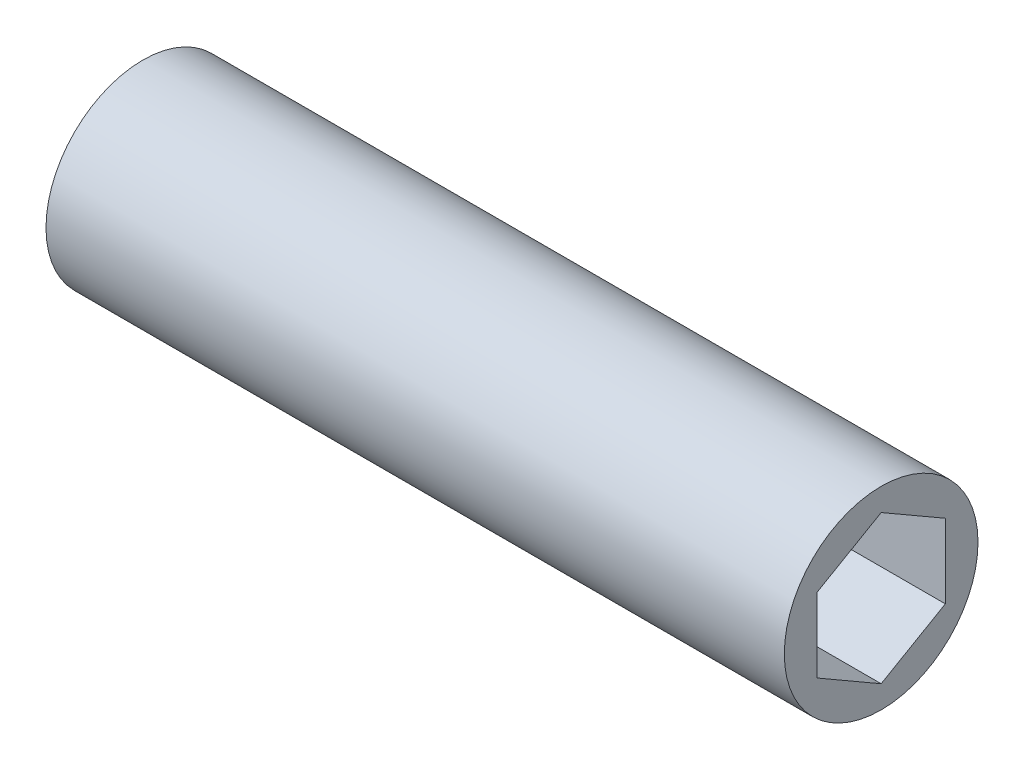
ISO-10303-21;
HEADER;
FILE_DESCRIPTION(('STEP AP214'),'2;1');
FILE_NAME('part.step','',(''),(''),'','','');
FILE_SCHEMA(('AUTOMOTIVE_DESIGN { 1 0 10303 214 1 1 1 1 }'));
ENDSEC;
DATA;
#1=APPLICATION_CONTEXT('core data for automotive mechanical design processes');
#2=APPLICATION_PROTOCOL_DEFINITION('international standard','automotive_design',2000,#1);
#3=PRODUCT_CONTEXT('',#1,'mechanical');
#4=PRODUCT('Part','Part','',(#3));
#5=PRODUCT_RELATED_PRODUCT_CATEGORY('part','',(#4));
#6=PRODUCT_DEFINITION_FORMATION('','',#4);
#7=PRODUCT_DEFINITION_CONTEXT('part definition',#1,'design');
#8=PRODUCT_DEFINITION('design','',#6,#7);
#9=PRODUCT_DEFINITION_SHAPE('','',#8);
#10=(LENGTH_UNIT() NAMED_UNIT(*) SI_UNIT(.MILLI.,.METRE.));
#11=(NAMED_UNIT(*) PLANE_ANGLE_UNIT() SI_UNIT($,.RADIAN.));
#12=(NAMED_UNIT(*) SI_UNIT($,.STERADIAN.) SOLID_ANGLE_UNIT());
#13=UNCERTAINTY_MEASURE_WITH_UNIT(LENGTH_MEASURE(1.E-05),#10,'distance_accuracy_value','');
#14=(GEOMETRIC_REPRESENTATION_CONTEXT(3) GLOBAL_UNCERTAINTY_ASSIGNED_CONTEXT((#13)) GLOBAL_UNIT_ASSIGNED_CONTEXT((#10,
#11,#12)) REPRESENTATION_CONTEXT('',''));
#15=CARTESIAN_POINT('',(0.,0.,0.));
#16=DIRECTION('',(0.,0.,1.));
#17=DIRECTION('',(1.,0.,0.));
#18=AXIS2_PLACEMENT_3D('',#15,#16,#17);
#19=CARTESIAN_POINT('',(-226.06,-96.8727012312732,310.598502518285));
#20=DIRECTION('',(1.,0.,0.));
#21=DIRECTION('',(0.,-1.,0.));
#22=AXIS2_PLACEMENT_3D('',#19,#20,#21);
#23=PLANE('',#22);
#24=CARTESIAN_POINT('',(-226.06,-96.8727012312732,310.598502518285));
#25=DIRECTION('',(1.,0.,0.));
#26=DIRECTION('',(0.,1.,0.));
#27=AXIS2_PLACEMENT_3D('',#24,#25,#26);
#28=CIRCLE('',#27,9.9949);
#29=CARTESIAN_POINT('',(-226.06,-86.8778012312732,310.598502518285));
#30=VERTEX_POINT('',#29);
#31=EDGE_CURVE('E11',#30,#30,#28,.T.);
#32=ORIENTED_EDGE('',*,*,#31,.F.);
#33=EDGE_LOOP('',(#32));
#34=FACE_BOUND('',#33,.T.);
#35=DIRECTION('',(0.,-1.,0.));
#36=VECTOR('',#35,1.);
#37=CARTESIAN_POINT('',(-226.06,-96.8727012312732,317.22401254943));
#38=LINE('',#37,#36);
#39=CARTESIAN_POINT('',(-226.06,-93.0474612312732,317.22401254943));
#40=VERTEX_POINT('',#39);
#41=CARTESIAN_POINT('',(-226.06,-100.697941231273,317.22401254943));
#42=VERTEX_POINT('',#41);
#43=EDGE_CURVE('E76',#40,#42,#38,.T.);
#44=ORIENTED_EDGE('',*,*,#43,.T.);
#45=DIRECTION('',(0.,-0.5,-0.866025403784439));
#46=VECTOR('',#45,1.);
#47=CARTESIAN_POINT('',(-226.06,-102.610561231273,313.911257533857));
#48=LINE('',#47,#46);
#49=CARTESIAN_POINT('',(-226.06,-104.523181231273,310.598502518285));
#50=VERTEX_POINT('',#49);
#51=EDGE_CURVE('E67',#42,#50,#48,.T.);
#52=ORIENTED_EDGE('',*,*,#51,.T.);
#53=DIRECTION('',(0.,0.5,-0.866025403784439));
#54=VECTOR('',#53,1.);
#55=CARTESIAN_POINT('',(-226.06,-102.610561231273,307.285747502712));
#56=LINE('',#55,#54);
#57=CARTESIAN_POINT('',(-226.06,-100.697941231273,303.97299248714));
#58=VERTEX_POINT('',#57);
#59=EDGE_CURVE('E71',#50,#58,#56,.T.);
#60=ORIENTED_EDGE('',*,*,#59,.T.);
#61=DIRECTION('',(0.,1.,0.));
#62=VECTOR('',#61,1.);
#63=CARTESIAN_POINT('',(-226.06,-96.8727012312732,303.97299248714));
#64=LINE('',#63,#62);
#65=CARTESIAN_POINT('',(-226.06,-93.0474612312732,303.97299248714));
#66=VERTEX_POINT('',#65);
#67=EDGE_CURVE('E106',#58,#66,#64,.T.);
#68=ORIENTED_EDGE('',*,*,#67,.T.);
#69=DIRECTION('',(0.,0.5,0.866025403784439));
#70=VECTOR('',#69,1.);
#71=CARTESIAN_POINT('',(-226.06,-91.1348412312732,307.285747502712));
#72=LINE('',#71,#70);
#73=CARTESIAN_POINT('',(-226.06,-89.2222212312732,310.598502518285));
#74=VERTEX_POINT('',#73);
#75=EDGE_CURVE('E229',#66,#74,#72,.T.);
#76=ORIENTED_EDGE('',*,*,#75,.T.);
#77=DIRECTION('',(0.,-0.5,0.866025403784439));
#78=VECTOR('',#77,1.);
#79=CARTESIAN_POINT('',(-226.06,-91.1348412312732,313.911257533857));
#80=LINE('',#79,#78);
#81=EDGE_CURVE('E231',#74,#40,#80,.T.);
#82=ORIENTED_EDGE('',*,*,#81,.T.);
#83=EDGE_LOOP('',(#44,#52,#60,#68,#76,#82));
#84=FACE_BOUND('',#83,.T.);
#85=ADVANCED_FACE('F17',(#34,#84),#23,.F.);
#86=CARTESIAN_POINT('',(-149.86,-96.8727012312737,310.598502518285));
#87=DIRECTION('',(1.,0.,0.));
#88=DIRECTION('',(0.,-1.,0.));
#89=AXIS2_PLACEMENT_3D('',#86,#87,#88);
#90=PLANE('',#89);
#91=CARTESIAN_POINT('',(-149.86,-96.8727012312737,310.598502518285));
#92=DIRECTION('',(1.,0.,0.));
#93=DIRECTION('',(0.,1.,0.));
#94=AXIS2_PLACEMENT_3D('',#91,#92,#93);
#95=CIRCLE('',#94,9.9949);
#96=CARTESIAN_POINT('',(-149.86,-86.8778012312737,310.598502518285));
#97=VERTEX_POINT('',#96);
#98=EDGE_CURVE('E25',#97,#97,#95,.T.);
#99=ORIENTED_EDGE('',*,*,#98,.T.);
#100=EDGE_LOOP('',(#99));
#101=FACE_BOUND('',#100,.T.);
#102=DIRECTION('',(0.,-1.,0.));
#103=VECTOR('',#102,1.);
#104=CARTESIAN_POINT('',(-149.86,-96.8727012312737,317.22401254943));
#105=LINE('',#104,#103);
#106=CARTESIAN_POINT('',(-149.86,-93.0474612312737,317.22401254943));
#107=VERTEX_POINT('',#106);
#108=CARTESIAN_POINT('',(-149.86,-100.697941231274,317.22401254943));
#109=VERTEX_POINT('',#108);
#110=EDGE_CURVE('E225',#107,#109,#105,.T.);
#111=ORIENTED_EDGE('',*,*,#110,.F.);
#112=DIRECTION('',(0.,-0.5,0.866025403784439));
#113=VECTOR('',#112,1.);
#114=CARTESIAN_POINT('',(-149.86,-91.1348412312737,313.911257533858));
#115=LINE('',#114,#113);
#116=CARTESIAN_POINT('',(-149.86,-89.2222212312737,310.598502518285));
#117=VERTEX_POINT('',#116);
#118=EDGE_CURVE('E223',#117,#107,#115,.T.);
#119=ORIENTED_EDGE('',*,*,#118,.F.);
#120=DIRECTION('',(0.,0.5,0.866025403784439));
#121=VECTOR('',#120,1.);
#122=CARTESIAN_POINT('',(-149.86,-91.1348412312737,307.285747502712));
#123=LINE('',#122,#121);
#124=CARTESIAN_POINT('',(-149.86,-93.0474612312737,303.97299248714));
#125=VERTEX_POINT('',#124);
#126=EDGE_CURVE('E210',#125,#117,#123,.T.);
#127=ORIENTED_EDGE('',*,*,#126,.F.);
#128=DIRECTION('',(0.,1.,0.));
#129=VECTOR('',#128,1.);
#130=CARTESIAN_POINT('',(-149.86,-96.8727012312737,303.97299248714));
#131=LINE('',#130,#129);
#132=CARTESIAN_POINT('',(-149.86,-100.697941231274,303.97299248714));
#133=VERTEX_POINT('',#132);
#134=EDGE_CURVE('E97',#133,#125,#131,.T.);
#135=ORIENTED_EDGE('',*,*,#134,.F.);
#136=DIRECTION('',(0.,0.5,-0.866025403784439));
#137=VECTOR('',#136,1.);
#138=CARTESIAN_POINT('',(-149.86,-102.610561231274,307.285747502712));
#139=LINE('',#138,#137);
#140=CARTESIAN_POINT('',(-149.86,-104.523181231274,310.598502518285));
#141=VERTEX_POINT('',#140);
#142=EDGE_CURVE('E82',#141,#133,#139,.T.);
#143=ORIENTED_EDGE('',*,*,#142,.F.);
#144=DIRECTION('',(0.,-0.5,-0.866025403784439));
#145=VECTOR('',#144,1.);
#146=CARTESIAN_POINT('',(-149.86,-102.610561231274,313.911257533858));
#147=LINE('',#146,#145);
#148=EDGE_CURVE('E81',#109,#141,#147,.T.);
#149=ORIENTED_EDGE('',*,*,#148,.F.);
#150=EDGE_LOOP('',(#111,#119,#127,#135,#143,#149));
#151=FACE_BOUND('',#150,.T.);
#152=ADVANCED_FACE('F168',(#101,#151),#90,.T.);
#153=CARTESIAN_POINT('',(-149.86,-96.8727012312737,310.598502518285));
#154=DIRECTION('',(-1.,0.,0.));
#155=DIRECTION('',(0.,-1.,0.));
#156=AXIS2_PLACEMENT_3D('',#153,#154,#155);
#157=CYLINDRICAL_SURFACE('',#156,9.9949);
#158=ORIENTED_EDGE('',*,*,#31,.T.);
#159=EDGE_LOOP('',(#158));
#160=FACE_BOUND('',#159,.T.);
#161=ORIENTED_EDGE('',*,*,#98,.F.);
#162=EDGE_LOOP('',(#161));
#163=FACE_BOUND('',#162,.T.);
#164=ADVANCED_FACE('F148',(#160,#163),#157,.T.);
#165=CARTESIAN_POINT('',(-149.86,-102.610561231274,313.911257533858));
#166=DIRECTION('',(0.,0.866025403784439,-0.5));
#167=DIRECTION('',(-1.,0.,0.));
#168=AXIS2_PLACEMENT_3D('',#165,#166,#167);
#169=PLANE('',#168);
#170=ORIENTED_EDGE('',*,*,#51,.F.);
#171=DIRECTION('',(-1.,0.,0.));
#172=VECTOR('',#171,1.);
#173=CARTESIAN_POINT('',(-149.86,-100.697941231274,317.22401254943));
#174=LINE('',#173,#172);
#175=EDGE_CURVE('E237',#109,#42,#174,.T.);
#176=ORIENTED_EDGE('',*,*,#175,.F.);
#177=ORIENTED_EDGE('',*,*,#148,.T.);
#178=DIRECTION('',(-1.,0.,0.));
#179=VECTOR('',#178,1.);
#180=CARTESIAN_POINT('',(-149.86,-104.523181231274,310.598502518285));
#181=LINE('',#180,#179);
#182=EDGE_CURVE('E85',#141,#50,#181,.T.);
#183=ORIENTED_EDGE('',*,*,#182,.T.);
#184=EDGE_LOOP('',(#170,#176,#177,#183));
#185=FACE_BOUND('',#184,.T.);
#186=ADVANCED_FACE('F86',(#185),#169,.T.);
#187=CARTESIAN_POINT('',(-149.86,-102.610561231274,307.285747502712));
#188=DIRECTION('',(0.,0.866025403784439,0.5));
#189=DIRECTION('',(1.,0.,0.));
#190=AXIS2_PLACEMENT_3D('',#187,#188,#189);
#191=PLANE('',#190);
#192=ORIENTED_EDGE('',*,*,#59,.F.);
#193=ORIENTED_EDGE('',*,*,#182,.F.);
#194=ORIENTED_EDGE('',*,*,#142,.T.);
#195=DIRECTION('',(-1.,0.,0.));
#196=VECTOR('',#195,1.);
#197=CARTESIAN_POINT('',(-149.86,-100.697941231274,303.97299248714));
#198=LINE('',#197,#196);
#199=EDGE_CURVE('E94',#133,#58,#198,.T.);
#200=ORIENTED_EDGE('',*,*,#199,.T.);
#201=EDGE_LOOP('',(#192,#193,#194,#200));
#202=FACE_BOUND('',#201,.T.);
#203=ADVANCED_FACE('F92',(#202),#191,.T.);
#204=CARTESIAN_POINT('',(-149.86,-96.8727012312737,303.97299248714));
#205=DIRECTION('',(0.,0.,1.));
#206=DIRECTION('',(1.,0.,0.));
#207=AXIS2_PLACEMENT_3D('',#204,#205,#206);
#208=PLANE('',#207);
#209=ORIENTED_EDGE('',*,*,#67,.F.);
#210=ORIENTED_EDGE('',*,*,#199,.F.);
#211=ORIENTED_EDGE('',*,*,#134,.T.);
#212=DIRECTION('',(-1.,0.,0.));
#213=VECTOR('',#212,1.);
#214=CARTESIAN_POINT('',(-149.86,-93.0474612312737,303.97299248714));
#215=LINE('',#214,#213);
#216=EDGE_CURVE('E217',#125,#66,#215,.T.);
#217=ORIENTED_EDGE('',*,*,#216,.T.);
#218=EDGE_LOOP('',(#209,#210,#211,#217));
#219=FACE_BOUND('',#218,.T.);
#220=ADVANCED_FACE('F140',(#219),#208,.T.);
#221=CARTESIAN_POINT('',(-149.86,-91.1348412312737,307.285747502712));
#222=DIRECTION('',(0.,-0.866025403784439,0.5));
#223=DIRECTION('',(-1.,0.,0.));
#224=AXIS2_PLACEMENT_3D('',#221,#222,#223);
#225=PLANE('',#224);
#226=ORIENTED_EDGE('',*,*,#75,.F.);
#227=ORIENTED_EDGE('',*,*,#216,.F.);
#228=ORIENTED_EDGE('',*,*,#126,.T.);
#229=DIRECTION('',(-1.,0.,0.));
#230=VECTOR('',#229,1.);
#231=CARTESIAN_POINT('',(-149.86,-89.2222212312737,310.598502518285));
#232=LINE('',#231,#230);
#233=EDGE_CURVE('E214',#117,#74,#232,.T.);
#234=ORIENTED_EDGE('',*,*,#233,.T.);
#235=EDGE_LOOP('',(#226,#227,#228,#234));
#236=FACE_BOUND('',#235,.T.);
#237=ADVANCED_FACE('F132',(#236),#225,.T.);
#238=CARTESIAN_POINT('',(-149.86,-91.1348412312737,313.911257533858));
#239=DIRECTION('',(0.,-0.866025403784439,-0.5));
#240=DIRECTION('',(0.,0.5,-0.866025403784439));
#241=AXIS2_PLACEMENT_3D('',#238,#239,#240);
#242=PLANE('',#241);
#243=ORIENTED_EDGE('',*,*,#81,.F.);
#244=ORIENTED_EDGE('',*,*,#233,.F.);
#245=ORIENTED_EDGE('',*,*,#118,.T.);
#246=DIRECTION('',(-1.,0.,0.));
#247=VECTOR('',#246,1.);
#248=CARTESIAN_POINT('',(-149.86,-93.0474612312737,317.22401254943));
#249=LINE('',#248,#247);
#250=EDGE_CURVE('E249',#107,#40,#249,.T.);
#251=ORIENTED_EDGE('',*,*,#250,.T.);
#252=EDGE_LOOP('',(#243,#244,#245,#251));
#253=FACE_BOUND('',#252,.T.);
#254=ADVANCED_FACE('F123',(#253),#242,.T.);
#255=CARTESIAN_POINT('',(-149.86,-96.8727012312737,317.22401254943));
#256=DIRECTION('',(0.,0.,-1.));
#257=DIRECTION('',(0.,-1.,0.));
#258=AXIS2_PLACEMENT_3D('',#255,#256,#257);
#259=PLANE('',#258);
#260=ORIENTED_EDGE('',*,*,#43,.F.);
#261=ORIENTED_EDGE('',*,*,#250,.F.);
#262=ORIENTED_EDGE('',*,*,#110,.T.);
#263=ORIENTED_EDGE('',*,*,#175,.T.);
#264=EDGE_LOOP('',(#260,#261,#262,#263));
#265=FACE_BOUND('',#264,.T.);
#266=ADVANCED_FACE('F118',(#265),#259,.T.);
#267=CLOSED_SHELL('',(#85,#152,#164,#186,#203,#220,#237,#254,#266));
#268=MANIFOLD_SOLID_BREP('B1',#267);
#269=ADVANCED_BREP_SHAPE_REPRESENTATION('',(#18,#268),#14);
#270=SHAPE_DEFINITION_REPRESENTATION(#9,#269);
ENDSEC;
END-ISO-10303-21;
